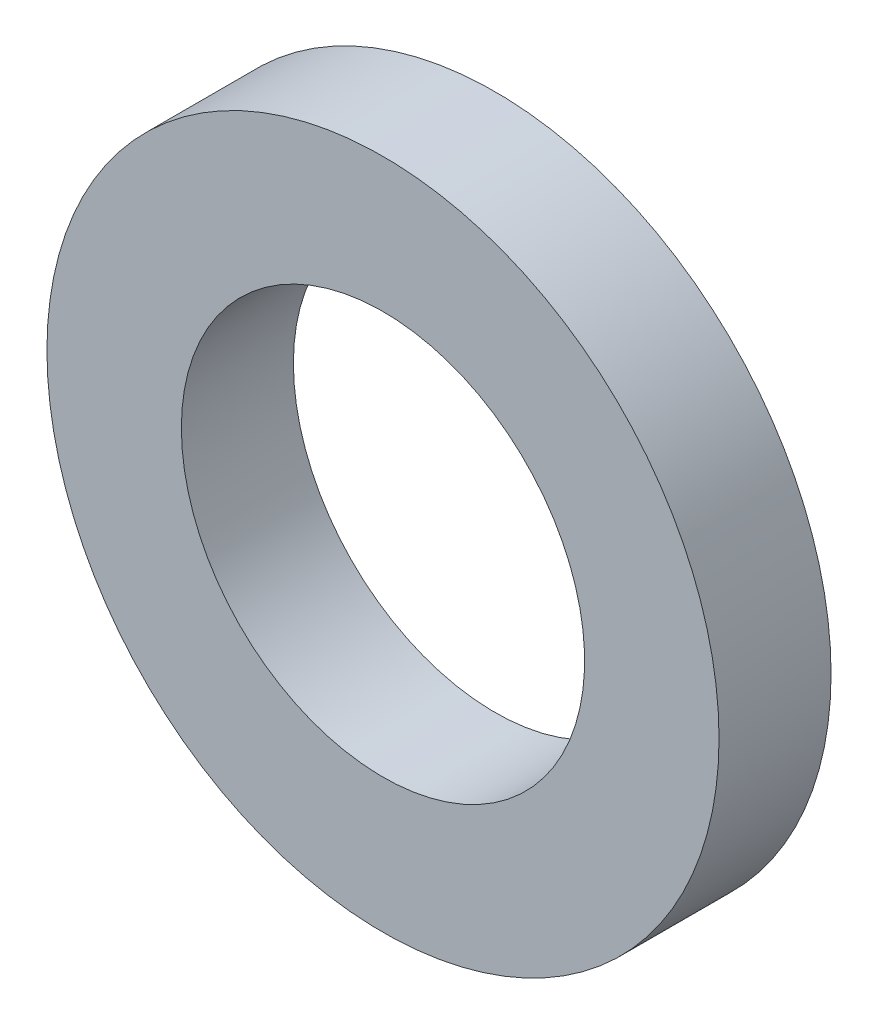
ISO-10303-21;
HEADER;
FILE_DESCRIPTION(('STEP AP214'),'2;1');
FILE_NAME('part.step','',(''),(''),'','','');
FILE_SCHEMA(('AUTOMOTIVE_DESIGN { 1 0 10303 214 1 1 1 1 }'));
ENDSEC;
DATA;
#1=APPLICATION_CONTEXT('core data for automotive mechanical design processes');
#2=APPLICATION_PROTOCOL_DEFINITION('international standard','automotive_design',2000,#1);
#3=PRODUCT_CONTEXT('',#1,'mechanical');
#4=PRODUCT('Part','Part','',(#3));
#5=PRODUCT_RELATED_PRODUCT_CATEGORY('part','',(#4));
#6=PRODUCT_DEFINITION_FORMATION('','',#4);
#7=PRODUCT_DEFINITION_CONTEXT('part definition',#1,'design');
#8=PRODUCT_DEFINITION('design','',#6,#7);
#9=PRODUCT_DEFINITION_SHAPE('','',#8);
#10=(LENGTH_UNIT() NAMED_UNIT(*) SI_UNIT(.MILLI.,.METRE.));
#11=(NAMED_UNIT(*) PLANE_ANGLE_UNIT() SI_UNIT($,.RADIAN.));
#12=(NAMED_UNIT(*) SI_UNIT($,.STERADIAN.) SOLID_ANGLE_UNIT());
#13=UNCERTAINTY_MEASURE_WITH_UNIT(LENGTH_MEASURE(1.E-05),#10,'distance_accuracy_value','');
#14=(GEOMETRIC_REPRESENTATION_CONTEXT(3) GLOBAL_UNCERTAINTY_ASSIGNED_CONTEXT((#13)) GLOBAL_UNIT_ASSIGNED_CONTEXT((#10,
#11,#12)) REPRESENTATION_CONTEXT('',''));
#15=CARTESIAN_POINT('',(0.,0.,0.));
#16=DIRECTION('',(0.,0.,1.));
#17=DIRECTION('',(1.,0.,0.));
#18=AXIS2_PLACEMENT_3D('',#15,#16,#17);
#19=CARTESIAN_POINT('',(0.,0.,6.35));
#20=DIRECTION('',(0.,0.,-1.));
#21=DIRECTION('',(-1.,0.,0.));
#22=AXIS2_PLACEMENT_3D('',#19,#20,#21);
#23=CYLINDRICAL_SURFACE('',#22,19.05);
#24=CARTESIAN_POINT('',(0.,0.,6.35));
#25=DIRECTION('',(0.,0.,1.));
#26=DIRECTION('',(1.,0.,0.));
#27=AXIS2_PLACEMENT_3D('',#24,#25,#26);
#28=CIRCLE('',#27,19.05);
#29=CARTESIAN_POINT('',(19.05,0.,6.35));
#30=VERTEX_POINT('',#29);
#31=EDGE_CURVE('E10',#30,#30,#28,.T.);
#32=ORIENTED_EDGE('',*,*,#31,.F.);
#33=EDGE_LOOP('',(#32));
#34=FACE_BOUND('',#33,.T.);
#35=CARTESIAN_POINT('',(0.,0.,0.));
#36=DIRECTION('',(0.,0.,1.));
#37=DIRECTION('',(1.,0.,0.));
#38=AXIS2_PLACEMENT_3D('',#35,#36,#37);
#39=CIRCLE('',#38,19.05);
#40=CARTESIAN_POINT('',(19.05,0.,0.));
#41=VERTEX_POINT('',#40);
#42=EDGE_CURVE('E36',#41,#41,#39,.T.);
#43=ORIENTED_EDGE('',*,*,#42,.T.);
#44=EDGE_LOOP('',(#43));
#45=FACE_BOUND('',#44,.T.);
#46=ADVANCED_FACE('F30',(#34,#45),#23,.T.);
#47=CARTESIAN_POINT('',(0.,0.,6.35));
#48=DIRECTION('',(0.,0.,1.));
#49=DIRECTION('',(1.,0.,0.));
#50=AXIS2_PLACEMENT_3D('',#47,#48,#49);
#51=PLANE('',#50);
#52=CARTESIAN_POINT('',(0.,0.,6.35));
#53=DIRECTION('',(0.,0.,-1.));
#54=DIRECTION('',(-1.,0.,0.));
#55=AXIS2_PLACEMENT_3D('',#52,#53,#54);
#56=CIRCLE('',#55,11.43);
#57=CARTESIAN_POINT('',(-11.43,0.,6.35));
#58=VERTEX_POINT('',#57);
#59=EDGE_CURVE('E40',#58,#58,#56,.T.);
#60=ORIENTED_EDGE('',*,*,#59,.T.);
#61=EDGE_LOOP('',(#60));
#62=FACE_BOUND('',#61,.T.);
#63=ORIENTED_EDGE('',*,*,#31,.T.);
#64=EDGE_LOOP('',(#63));
#65=FACE_BOUND('',#64,.T.);
#66=ADVANCED_FACE('F55',(#62,#65),#51,.T.);
#67=CARTESIAN_POINT('',(0.,0.,0.));
#68=DIRECTION('',(0.,0.,1.));
#69=DIRECTION('',(1.,0.,0.));
#70=AXIS2_PLACEMENT_3D('',#67,#68,#69);
#71=PLANE('',#70);
#72=CARTESIAN_POINT('',(0.,0.,0.));
#73=DIRECTION('',(0.,0.,-1.));
#74=DIRECTION('',(-1.,0.,0.));
#75=AXIS2_PLACEMENT_3D('',#72,#73,#74);
#76=CIRCLE('',#75,11.43);
#77=CARTESIAN_POINT('',(-11.43,0.,0.));
#78=VERTEX_POINT('',#77);
#79=EDGE_CURVE('E44',#78,#78,#76,.T.);
#80=ORIENTED_EDGE('',*,*,#79,.F.);
#81=EDGE_LOOP('',(#80));
#82=FACE_BOUND('',#81,.T.);
#83=ORIENTED_EDGE('',*,*,#42,.F.);
#84=EDGE_LOOP('',(#83));
#85=FACE_BOUND('',#84,.T.);
#86=ADVANCED_FACE('F52',(#82,#85),#71,.F.);
#87=CARTESIAN_POINT('',(0.,0.,6.35));
#88=DIRECTION('',(0.,0.,-1.));
#89=DIRECTION('',(-1.,0.,0.));
#90=AXIS2_PLACEMENT_3D('',#87,#88,#89);
#91=CYLINDRICAL_SURFACE('',#90,11.43);
#92=ORIENTED_EDGE('',*,*,#59,.F.);
#93=EDGE_LOOP('',(#92));
#94=FACE_BOUND('',#93,.T.);
#95=ORIENTED_EDGE('',*,*,#79,.T.);
#96=EDGE_LOOP('',(#95));
#97=FACE_BOUND('',#96,.T.);
#98=ADVANCED_FACE('F50',(#94,#97),#91,.F.);
#99=CLOSED_SHELL('',(#46,#66,#86,#98));
#100=MANIFOLD_SOLID_BREP('B2',#99);
#101=ADVANCED_BREP_SHAPE_REPRESENTATION('',(#18,#100),#14);
#102=SHAPE_DEFINITION_REPRESENTATION(#9,#101);
ENDSEC;
END-ISO-10303-21;
